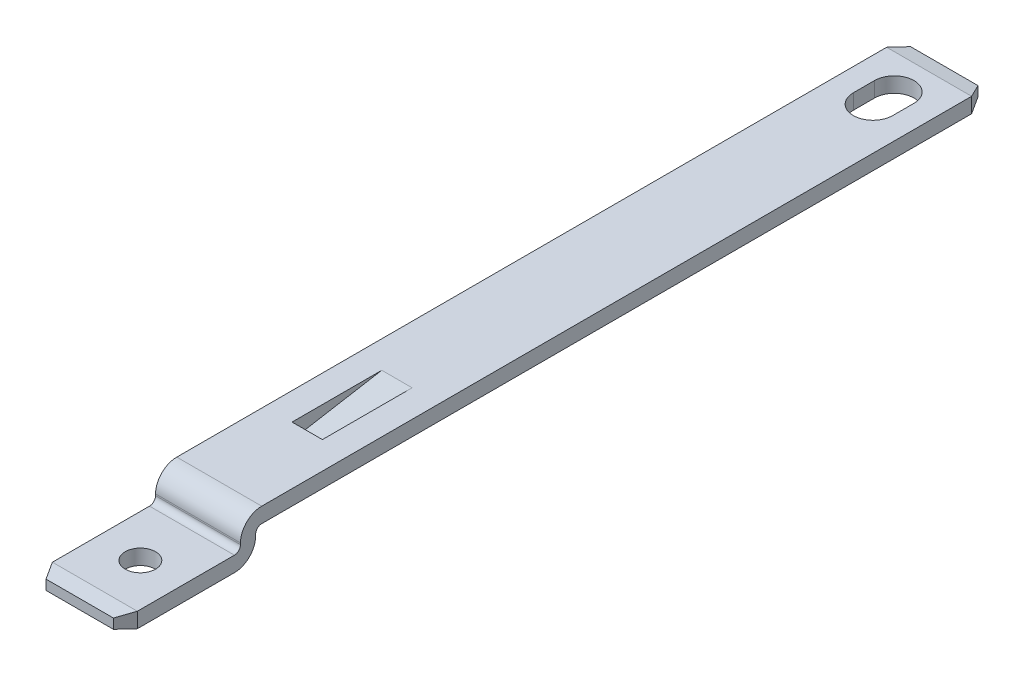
ISO-10303-21;
HEADER;
FILE_DESCRIPTION(('STEP AP214'),'2;1');
FILE_NAME('part.step','',(''),(''),'','','');
FILE_SCHEMA(('AUTOMOTIVE_DESIGN { 1 0 10303 214 1 1 1 1 }'));
ENDSEC;
DATA;
#1=APPLICATION_CONTEXT('core data for automotive mechanical design processes');
#2=APPLICATION_PROTOCOL_DEFINITION('international standard','automotive_design',2000,#1);
#3=PRODUCT_CONTEXT('',#1,'mechanical');
#4=PRODUCT('Part','Part','',(#3));
#5=PRODUCT_RELATED_PRODUCT_CATEGORY('part','',(#4));
#6=PRODUCT_DEFINITION_FORMATION('','',#4);
#7=PRODUCT_DEFINITION_CONTEXT('part definition',#1,'design');
#8=PRODUCT_DEFINITION('design','',#6,#7);
#9=PRODUCT_DEFINITION_SHAPE('','',#8);
#10=(LENGTH_UNIT() NAMED_UNIT(*) SI_UNIT(.MILLI.,.METRE.));
#11=(NAMED_UNIT(*) PLANE_ANGLE_UNIT() SI_UNIT($,.RADIAN.));
#12=(NAMED_UNIT(*) SI_UNIT($,.STERADIAN.) SOLID_ANGLE_UNIT());
#13=UNCERTAINTY_MEASURE_WITH_UNIT(LENGTH_MEASURE(1.E-05),#10,'distance_accuracy_value','');
#14=(GEOMETRIC_REPRESENTATION_CONTEXT(3) GLOBAL_UNCERTAINTY_ASSIGNED_CONTEXT((#13)) GLOBAL_UNIT_ASSIGNED_CONTEXT((#10,
#11,#12)) REPRESENTATION_CONTEXT('',''));
#15=CARTESIAN_POINT('',(0.,0.,0.));
#16=DIRECTION('',(0.,0.,1.));
#17=DIRECTION('',(1.,0.,0.));
#18=AXIS2_PLACEMENT_3D('',#15,#16,#17);
#19=CARTESIAN_POINT('',(1.45,3.10000000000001,4.5436678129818));
#20=DIRECTION('',(0.,0.,-1.));
#21=DIRECTION('',(0.,1.,0.));
#22=AXIS2_PLACEMENT_3D('',#19,#20,#21);
#23=PLANE('',#22);
#24=DIRECTION('',(0.,1.,0.));
#25=VECTOR('',#24,1.);
#26=CARTESIAN_POINT('',(1.16132486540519,3.10000000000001,4.5436678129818));
#27=LINE('',#26,#25);
#28=CARTESIAN_POINT('',(1.16132486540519,3.51183650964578,4.5436678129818));
#29=VERTEX_POINT('',#28);
#30=CARTESIAN_POINT('',(1.16132486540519,3.18816349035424,4.5436678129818));
#31=VERTEX_POINT('',#30);
#32=EDGE_CURVE('E344',#29,#31,#27,.F.);
#33=ORIENTED_EDGE('',*,*,#32,.F.);
#34=DIRECTION('',(1.,0.,0.));
#35=VECTOR('',#34,1.);
#36=CARTESIAN_POINT('',(1.45,3.51183650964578,4.5436678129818));
#37=LINE('',#36,#35);
#38=CARTESIAN_POINT('',(-1.06132486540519,3.51183650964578,4.5436678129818));
#39=VERTEX_POINT('',#38);
#40=EDGE_CURVE('E325',#29,#39,#37,.F.);
#41=ORIENTED_EDGE('',*,*,#40,.T.);
#42=DIRECTION('',(0.,1.,0.));
#43=VECTOR('',#42,1.);
#44=CARTESIAN_POINT('',(-1.06132486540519,3.10000000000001,4.5436678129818));
#45=LINE('',#44,#43);
#46=CARTESIAN_POINT('',(-1.06132486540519,3.18816349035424,4.5436678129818));
#47=VERTEX_POINT('',#46);
#48=EDGE_CURVE('E350',#47,#39,#45,.T.);
#49=ORIENTED_EDGE('',*,*,#48,.F.);
#50=DIRECTION('',(1.,0.,0.));
#51=VECTOR('',#50,1.);
#52=CARTESIAN_POINT('',(1.45,3.18816349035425,4.5436678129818));
#53=LINE('',#52,#51);
#54=EDGE_CURVE('E321',#31,#47,#53,.F.);
#55=ORIENTED_EDGE('',*,*,#54,.F.);
#56=EDGE_LOOP('',(#33,#41,#49,#55));
#57=FACE_BOUND('',#56,.T.);
#58=ADVANCED_FACE('F14',(#57),#23,.F.);
#59=CARTESIAN_POINT('',(1.45,3.85000000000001,0.1436678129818));
#60=DIRECTION('',(0.,0.,1.));
#61=DIRECTION('',(0.,-1.,0.));
#62=AXIS2_PLACEMENT_3D('',#59,#60,#61);
#63=PLANE('',#62);
#64=DIRECTION('',(-1.,0.,0.));
#65=VECTOR('',#64,1.);
#66=CARTESIAN_POINT('',(1.45,3.80000000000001,0.143667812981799));
#67=LINE('',#66,#65);
#68=CARTESIAN_POINT('',(-1.35,3.80000000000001,0.143667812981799));
#69=VERTEX_POINT('',#68);
#70=CARTESIAN_POINT('',(1.45,3.80000000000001,0.1436678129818));
#71=VERTEX_POINT('',#70);
#72=EDGE_CURVE('E345',#69,#71,#67,.F.);
#73=ORIENTED_EDGE('',*,*,#72,.F.);
#74=DIRECTION('',(0.,-1.,0.));
#75=VECTOR('',#74,1.);
#76=CARTESIAN_POINT('',(-1.35,3.85000000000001,0.1436678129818));
#77=LINE('',#76,#75);
#78=CARTESIAN_POINT('',(-1.35,3.85000000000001,0.143667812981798));
#79=VERTEX_POINT('',#78);
#80=EDGE_CURVE('E341',#79,#69,#77,.T.);
#81=ORIENTED_EDGE('',*,*,#80,.F.);
#82=DIRECTION('',(1.,0.,0.));
#83=VECTOR('',#82,1.);
#84=CARTESIAN_POINT('',(-1.35,3.85000000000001,0.143667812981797));
#85=LINE('',#84,#83);
#86=CARTESIAN_POINT('',(1.45,3.85000000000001,0.143667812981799));
#87=VERTEX_POINT('',#86);
#88=EDGE_CURVE('E336',#79,#87,#85,.T.);
#89=ORIENTED_EDGE('',*,*,#88,.T.);
#90=DIRECTION('',(0.,-1.,0.));
#91=VECTOR('',#90,1.);
#92=CARTESIAN_POINT('',(1.45,3.85000000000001,0.1436678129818));
#93=LINE('',#92,#91);
#94=EDGE_CURVE('E335',#71,#87,#93,.F.);
#95=ORIENTED_EDGE('',*,*,#94,.F.);
#96=EDGE_LOOP('',(#73,#81,#89,#95));
#97=FACE_BOUND('',#96,.T.);
#98=ADVANCED_FACE('F441',(#97),#63,.F.);
#99=CARTESIAN_POINT('',(-0.449999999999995,3.54000000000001,-3.));
#100=DIRECTION('',(0.,-0.985444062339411,-0.169999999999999));
#101=DIRECTION('',(0.,0.169999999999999,-0.985444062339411));
#102=AXIS2_PLACEMENT_3D('',#99,#100,#101);
#103=PLANE('',#102);
#104=DIRECTION('',(0.,0.170000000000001,-0.98544406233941));
#105=VECTOR('',#104,1.);
#106=CARTESIAN_POINT('',(-0.449999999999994,3.54000000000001,-3.));
#107=LINE('',#106,#105);
#108=CARTESIAN_POINT('',(-0.449999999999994,3.54000000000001,-3.));
#109=VERTEX_POINT('',#108);
#110=CARTESIAN_POINT('',(-0.449999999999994,4.05000000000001,-5.9563321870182));
#111=VERTEX_POINT('',#110);
#112=EDGE_CURVE('E317',#109,#111,#107,.T.);
#113=ORIENTED_EDGE('',*,*,#112,.T.);
#114=DIRECTION('',(1.,0.,0.));
#115=VECTOR('',#114,1.);
#116=CARTESIAN_POINT('',(-0.449999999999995,4.05,-5.9563321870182));
#117=LINE('',#116,#115);
#118=CARTESIAN_POINT('',(0.550000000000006,4.05000000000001,-5.9563321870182));
#119=VERTEX_POINT('',#118);
#120=EDGE_CURVE('E200',#111,#119,#117,.T.);
#121=ORIENTED_EDGE('',*,*,#120,.T.);
#122=DIRECTION('',(0.,0.170000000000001,-0.98544406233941));
#123=VECTOR('',#122,1.);
#124=CARTESIAN_POINT('',(0.550000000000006,3.54000000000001,-3.));
#125=LINE('',#124,#123);
#126=CARTESIAN_POINT('',(0.550000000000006,3.54000000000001,-3.));
#127=VERTEX_POINT('',#126);
#128=EDGE_CURVE('E307',#127,#119,#125,.T.);
#129=ORIENTED_EDGE('',*,*,#128,.F.);
#130=DIRECTION('',(1.,0.,0.));
#131=VECTOR('',#130,1.);
#132=CARTESIAN_POINT('',(-0.449999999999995,3.54000000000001,-3.));
#133=LINE('',#132,#131);
#134=EDGE_CURVE('E310',#109,#127,#133,.T.);
#135=ORIENTED_EDGE('',*,*,#134,.F.);
#136=EDGE_LOOP('',(#113,#121,#129,#135));
#137=FACE_BOUND('',#136,.T.);
#138=ADVANCED_FACE('F524',(#137),#103,.T.);
#139=CARTESIAN_POINT('',(1.45,3.80000000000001,0.843667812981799));
#140=DIRECTION('',(-1.,0.,0.));
#141=DIRECTION('',(0.,0.,1.));
#142=AXIS2_PLACEMENT_3D('',#139,#140,#141);
#143=CYLINDRICAL_SURFACE('',#142,0.2);
#144=CARTESIAN_POINT('',(1.45,3.80000000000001,0.843667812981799));
#145=DIRECTION('',(-1.,0.,0.));
#146=DIRECTION('',(0.,0.,1.));
#147=AXIS2_PLACEMENT_3D('',#144,#145,#146);
#148=CIRCLE('',#147,0.2);
#149=CARTESIAN_POINT('',(1.45,3.80000000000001,0.6436678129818));
#150=VERTEX_POINT('',#149);
#151=CARTESIAN_POINT('',(1.45,3.60000000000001,0.843667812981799));
#152=VERTEX_POINT('',#151);
#153=EDGE_CURVE('E199',#150,#152,#148,.T.);
#154=ORIENTED_EDGE('',*,*,#153,.F.);
#155=DIRECTION('',(1.,0.,0.));
#156=VECTOR('',#155,1.);
#157=CARTESIAN_POINT('',(1.45,3.80000000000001,0.6436678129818));
#158=LINE('',#157,#156);
#159=CARTESIAN_POINT('',(-1.35,3.80000000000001,0.6436678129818));
#160=VERTEX_POINT('',#159);
#161=EDGE_CURVE('E196',#160,#150,#158,.T.);
#162=ORIENTED_EDGE('',*,*,#161,.F.);
#163=CARTESIAN_POINT('',(-1.35,3.80000000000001,0.843667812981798));
#164=DIRECTION('',(-1.,0.,0.));
#165=DIRECTION('',(0.,0.,1.));
#166=AXIS2_PLACEMENT_3D('',#163,#164,#165);
#167=CIRCLE('',#166,0.2);
#168=CARTESIAN_POINT('',(-1.35,3.60000000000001,0.843667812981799));
#169=VERTEX_POINT('',#168);
#170=EDGE_CURVE('E17',#169,#160,#167,.F.);
#171=ORIENTED_EDGE('',*,*,#170,.F.);
#172=DIRECTION('',(1.,0.,0.));
#173=VECTOR('',#172,1.);
#174=CARTESIAN_POINT('',(1.45,3.60000000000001,0.843667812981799));
#175=LINE('',#174,#173);
#176=EDGE_CURVE('E193',#169,#152,#175,.T.);
#177=ORIENTED_EDGE('',*,*,#176,.T.);
#178=EDGE_LOOP('',(#154,#162,#171,#177));
#179=FACE_BOUND('',#178,.T.);
#180=ADVANCED_FACE('F192',(#179),#143,.F.);
#181=CARTESIAN_POINT('',(1.45,3.51183650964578,4.5436678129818));
#182=DIRECTION('',(0.,-0.984807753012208,-0.17364817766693));
#183=DIRECTION('',(0.,0.17364817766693,-0.984807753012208));
#184=AXIS2_PLACEMENT_3D('',#181,#182,#183);
#185=PLANE('',#184);
#186=DIRECTION('',(-0.494270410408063,-0.150953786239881,0.8561014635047));
#187=VECTOR('',#186,1.);
#188=CARTESIAN_POINT('',(1.45,3.60000000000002,4.0436678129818));
#189=LINE('',#188,#187);
#190=CARTESIAN_POINT('',(1.45,3.60000000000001,4.0436678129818));
#191=VERTEX_POINT('',#190);
#192=EDGE_CURVE('E326',#191,#29,#189,.T.);
#193=ORIENTED_EDGE('',*,*,#192,.F.);
#194=DIRECTION('',(1.,0.,0.));
#195=VECTOR('',#194,1.);
#196=CARTESIAN_POINT('',(1.45,3.60000000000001,4.0436678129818));
#197=LINE('',#196,#195);
#198=CARTESIAN_POINT('',(-1.35,3.60000000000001,4.0436678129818));
#199=VERTEX_POINT('',#198);
#200=EDGE_CURVE('E208',#191,#199,#197,.F.);
#201=ORIENTED_EDGE('',*,*,#200,.T.);
#202=DIRECTION('',(-0.494270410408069,0.150953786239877,-0.856101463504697));
#203=VECTOR('',#202,1.);
#204=CARTESIAN_POINT('',(-1.06132486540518,3.51183650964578,4.5436678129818));
#205=LINE('',#204,#203);
#206=EDGE_CURVE('E293',#39,#199,#205,.T.);
#207=ORIENTED_EDGE('',*,*,#206,.F.);
#208=ORIENTED_EDGE('',*,*,#40,.F.);
#209=EDGE_LOOP('',(#193,#201,#207,#208));
#210=FACE_BOUND('',#209,.T.);
#211=ADVANCED_FACE('F462',(#210),#185,.F.);
#212=CARTESIAN_POINT('',(1.45,3.10000000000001,4.0436678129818));
#213=DIRECTION('',(0.,-0.984807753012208,0.173648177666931));
#214=DIRECTION('',(0.,-0.173648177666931,-0.984807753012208));
#215=AXIS2_PLACEMENT_3D('',#212,#213,#214);
#216=PLANE('',#215);
#217=ORIENTED_EDGE('',*,*,#54,.T.);
#218=DIRECTION('',(0.494270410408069,0.150953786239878,0.856101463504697));
#219=VECTOR('',#218,1.);
#220=CARTESIAN_POINT('',(-1.35,3.10000000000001,4.0436678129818));
#221=LINE('',#220,#219);
#222=CARTESIAN_POINT('',(-1.35,3.10000000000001,4.0436678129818));
#223=VERTEX_POINT('',#222);
#224=EDGE_CURVE('E295',#223,#47,#221,.T.);
#225=ORIENTED_EDGE('',*,*,#224,.F.);
#226=DIRECTION('',(1.,0.,0.));
#227=VECTOR('',#226,1.);
#228=CARTESIAN_POINT('',(1.45,3.10000000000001,4.0436678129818));
#229=LINE('',#228,#227);
#230=CARTESIAN_POINT('',(1.45,3.1,4.0436678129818));
#231=VERTEX_POINT('',#230);
#232=EDGE_CURVE('E264',#231,#223,#229,.F.);
#233=ORIENTED_EDGE('',*,*,#232,.F.);
#234=DIRECTION('',(0.494270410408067,-0.15095378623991,-0.856101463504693));
#235=VECTOR('',#234,1.);
#236=CARTESIAN_POINT('',(1.16132486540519,3.18816349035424,4.5436678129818));
#237=LINE('',#236,#235);
#238=EDGE_CURVE('E266',#31,#231,#237,.T.);
#239=ORIENTED_EDGE('',*,*,#238,.F.);
#240=EDGE_LOOP('',(#217,#225,#233,#239));
#241=FACE_BOUND('',#240,.T.);
#242=ADVANCED_FACE('F455',(#241),#216,.T.);
#243=CARTESIAN_POINT('',(1.45,3.80000000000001,0.843667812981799));
#244=DIRECTION('',(-1.,0.,0.));
#245=DIRECTION('',(0.,0.,1.));
#246=AXIS2_PLACEMENT_3D('',#243,#244,#245);
#247=CYLINDRICAL_SURFACE('',#246,0.7);
#248=ORIENTED_EDGE('',*,*,#72,.T.);
#249=CARTESIAN_POINT('',(1.45,3.80000000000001,0.843667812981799));
#250=DIRECTION('',(-1.,0.,0.));
#251=DIRECTION('',(0.,0.,1.));
#252=AXIS2_PLACEMENT_3D('',#249,#250,#251);
#253=CIRCLE('',#252,0.7);
#254=CARTESIAN_POINT('',(1.45,3.1,0.843667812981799));
#255=VERTEX_POINT('',#254);
#256=EDGE_CURVE('E348',#71,#255,#253,.T.);
#257=ORIENTED_EDGE('',*,*,#256,.T.);
#258=DIRECTION('',(1.,0.,0.));
#259=VECTOR('',#258,1.);
#260=CARTESIAN_POINT('',(1.45,3.10000000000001,0.843667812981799));
#261=LINE('',#260,#259);
#262=CARTESIAN_POINT('',(-1.35,3.10000000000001,0.843667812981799));
#263=VERTEX_POINT('',#262);
#264=EDGE_CURVE('E260',#263,#255,#261,.T.);
#265=ORIENTED_EDGE('',*,*,#264,.F.);
#266=CARTESIAN_POINT('',(-1.35,3.80000000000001,0.843667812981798));
#267=DIRECTION('',(-1.,0.,0.));
#268=DIRECTION('',(0.,0.,1.));
#269=AXIS2_PLACEMENT_3D('',#266,#267,#268);
#270=CIRCLE('',#269,0.7);
#271=EDGE_CURVE('E324',#263,#69,#270,.F.);
#272=ORIENTED_EDGE('',*,*,#271,.T.);
#273=EDGE_LOOP('',(#248,#257,#265,#272));
#274=FACE_BOUND('',#273,.T.);
#275=ADVANCED_FACE('F446',(#274),#247,.T.);
#276=CARTESIAN_POINT('',(0.0499999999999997,-25.0738992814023,2.54366781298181));
#277=DIRECTION('',(0.,1.,0.));
#278=DIRECTION('',(0.,0.,1.));
#279=AXIS2_PLACEMENT_3D('',#276,#277,#278);
#280=CYLINDRICAL_SURFACE('',#279,0.5);
#281=CARTESIAN_POINT('',(0.0499999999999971,3.60000000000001,2.5436678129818));
#282=DIRECTION('',(0.,1.,0.));
#283=DIRECTION('',(0.,0.,1.));
#284=AXIS2_PLACEMENT_3D('',#281,#282,#283);
#285=CIRCLE('',#284,0.5);
#286=CARTESIAN_POINT('',(0.0499999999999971,3.60000000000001,3.0436678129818));
#287=VERTEX_POINT('',#286);
#288=EDGE_CURVE('E271',#287,#287,#285,.T.);
#289=ORIENTED_EDGE('',*,*,#288,.T.);
#290=EDGE_LOOP('',(#289));
#291=FACE_BOUND('',#290,.T.);
#292=CARTESIAN_POINT('',(0.0499999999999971,3.10000000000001,2.5436678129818));
#293=DIRECTION('',(0.,1.,0.));
#294=DIRECTION('',(0.,0.,1.));
#295=AXIS2_PLACEMENT_3D('',#292,#293,#294);
#296=CIRCLE('',#295,0.5);
#297=CARTESIAN_POINT('',(0.0499999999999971,3.10000000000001,3.0436678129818));
#298=VERTEX_POINT('',#297);
#299=EDGE_CURVE('E263',#298,#298,#296,.T.);
#300=ORIENTED_EDGE('',*,*,#299,.F.);
#301=EDGE_LOOP('',(#300));
#302=FACE_BOUND('',#301,.T.);
#303=ADVANCED_FACE('F602',(#291,#302),#280,.F.);
#304=CARTESIAN_POINT('',(1.45000000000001,4.05,-23.4563321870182));
#305=DIRECTION('',(0.,-0.984807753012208,-0.173648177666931));
#306=DIRECTION('',(0.,0.173648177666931,-0.984807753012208));
#307=AXIS2_PLACEMENT_3D('',#304,#305,#306);
#308=PLANE('',#307);
#309=DIRECTION('',(1.,0.,0.));
#310=VECTOR('',#309,1.);
#311=CARTESIAN_POINT('',(-1.34999999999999,4.13816349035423,-23.9563321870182));
#312=LINE('',#311,#310);
#313=CARTESIAN_POINT('',(-1.06132486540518,4.13816349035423,-23.9563321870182));
#314=VERTEX_POINT('',#313);
#315=CARTESIAN_POINT('',(1.1613248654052,4.13816349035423,-23.9563321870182));
#316=VERTEX_POINT('',#315);
#317=EDGE_CURVE('E278',#314,#316,#312,.T.);
#318=ORIENTED_EDGE('',*,*,#317,.T.);
#319=DIRECTION('',(-0.494270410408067,0.150953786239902,-0.856101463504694));
#320=VECTOR('',#319,1.);
#321=CARTESIAN_POINT('',(1.44999999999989,4.05000000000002,-23.4563321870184));
#322=LINE('',#321,#320);
#323=CARTESIAN_POINT('',(1.44999999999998,4.05000000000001,-23.4563321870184));
#324=VERTEX_POINT('',#323);
#325=EDGE_CURVE('E276',#324,#316,#322,.T.);
#326=ORIENTED_EDGE('',*,*,#325,.F.);
#327=DIRECTION('',(1.,0.,0.));
#328=VECTOR('',#327,1.);
#329=CARTESIAN_POINT('',(1.45,4.05,-23.4563321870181));
#330=LINE('',#329,#328);
#331=CARTESIAN_POINT('',(-1.35,4.05,-23.4563321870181));
#332=VERTEX_POINT('',#331);
#333=EDGE_CURVE('E281',#332,#324,#330,.T.);
#334=ORIENTED_EDGE('',*,*,#333,.F.);
#335=DIRECTION('',(-0.49427041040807,-0.150953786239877,0.856101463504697));
#336=VECTOR('',#335,1.);
#337=CARTESIAN_POINT('',(-1.06132486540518,4.13816349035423,-23.9563321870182));
#338=LINE('',#337,#336);
#339=EDGE_CURVE('E291',#314,#332,#338,.T.);
#340=ORIENTED_EDGE('',*,*,#339,.F.);
#341=EDGE_LOOP('',(#318,#326,#334,#340));
#342=FACE_BOUND('',#341,.T.);
#343=ADVANCED_FACE('F426',(#342),#308,.T.);
#344=CARTESIAN_POINT('',(-1.35,3.85000000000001,-0.056332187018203));
#345=DIRECTION('',(1.,0.,0.));
#346=DIRECTION('',(0.,0.,-1.));
#347=AXIS2_PLACEMENT_3D('',#344,#345,#346);
#348=CYLINDRICAL_SURFACE('',#347,0.2);
#349=CARTESIAN_POINT('',(1.45,3.85000000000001,-0.056332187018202));
#350=DIRECTION('',(1.,0.,0.));
#351=DIRECTION('',(0.,0.,-1.));
#352=AXIS2_PLACEMENT_3D('',#349,#350,#351);
#353=CIRCLE('',#352,0.2);
#354=CARTESIAN_POINT('',(1.45,4.05000000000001,-0.0563321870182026));
#355=VERTEX_POINT('',#354);
#356=EDGE_CURVE('E320',#87,#355,#353,.F.);
#357=ORIENTED_EDGE('',*,*,#356,.F.);
#358=ORIENTED_EDGE('',*,*,#88,.F.);
#359=CARTESIAN_POINT('',(-1.35,3.85000000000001,-0.056332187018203));
#360=DIRECTION('',(1.,0.,0.));
#361=DIRECTION('',(0.,0.,-1.));
#362=AXIS2_PLACEMENT_3D('',#359,#360,#361);
#363=CIRCLE('',#362,0.2);
#364=CARTESIAN_POINT('',(-1.35,4.05,-0.056332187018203));
#365=VERTEX_POINT('',#364);
#366=EDGE_CURVE('E339',#365,#79,#363,.T.);
#367=ORIENTED_EDGE('',*,*,#366,.F.);
#368=DIRECTION('',(1.,0.,0.));
#369=VECTOR('',#368,1.);
#370=CARTESIAN_POINT('',(1.45,4.05000000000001,-0.0563321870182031));
#371=LINE('',#370,#369);
#372=EDGE_CURVE('E255',#355,#365,#371,.F.);
#373=ORIENTED_EDGE('',*,*,#372,.F.);
#374=EDGE_LOOP('',(#357,#358,#367,#373));
#375=FACE_BOUND('',#374,.T.);
#376=ADVANCED_FACE('F437',(#375),#348,.F.);
#377=CARTESIAN_POINT('',(-0.449999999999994,4.05000000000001,-5.9563321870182));
#378=DIRECTION('',(1.,0.,0.));
#379=DIRECTION('',(0.,1.,0.));
#380=AXIS2_PLACEMENT_3D('',#377,#378,#379);
#381=PLANE('',#380);
#382=DIRECTION('',(0.,0.,-1.));
#383=VECTOR('',#382,1.);
#384=CARTESIAN_POINT('',(-0.449999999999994,4.05000000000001,4.5436678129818));
#385=LINE('',#384,#383);
#386=CARTESIAN_POINT('',(-0.449999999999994,4.05000000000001,-3.01515571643));
#387=VERTEX_POINT('',#386);
#388=EDGE_CURVE('E247',#111,#387,#385,.F.);
#389=ORIENTED_EDGE('',*,*,#388,.F.);
#390=ORIENTED_EDGE('',*,*,#112,.F.);
#391=DIRECTION('',(0.,-1.,0.));
#392=VECTOR('',#391,1.);
#393=CARTESIAN_POINT('',(-0.449999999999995,4.04738547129,-3.));
#394=LINE('',#393,#392);
#395=CARTESIAN_POINT('',(-0.449999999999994,4.04738547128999,-3.));
#396=VERTEX_POINT('',#395);
#397=EDGE_CURVE('E312',#396,#109,#394,.T.);
#398=ORIENTED_EDGE('',*,*,#397,.F.);
#399=DIRECTION('',(0.,-0.169999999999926,0.985444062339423));
#400=VECTOR('',#399,1.);
#401=CARTESIAN_POINT('',(-0.449999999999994,4.05000000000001,-3.01515571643));
#402=LINE('',#401,#400);
#403=EDGE_CURVE('E315',#387,#396,#402,.T.);
#404=ORIENTED_EDGE('',*,*,#403,.F.);
#405=EDGE_LOOP('',(#389,#390,#398,#404));
#406=FACE_BOUND('',#405,.T.);
#407=ADVANCED_FACE('F514',(#406),#381,.F.);
#408=CARTESIAN_POINT('',(-0.449999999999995,4.04738547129,-3.));
#409=DIRECTION('',(0.,0.,1.));
#410=DIRECTION('',(0.,-1.,0.));
#411=AXIS2_PLACEMENT_3D('',#408,#409,#410);
#412=PLANE('',#411);
#413=ORIENTED_EDGE('',*,*,#397,.T.);
#414=ORIENTED_EDGE('',*,*,#134,.T.);
#415=DIRECTION('',(0.,1.,0.));
#416=VECTOR('',#415,1.);
#417=CARTESIAN_POINT('',(0.550000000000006,4.05000000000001,-3.));
#418=LINE('',#417,#416);
#419=CARTESIAN_POINT('',(0.550000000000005,4.04738547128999,-3.));
#420=VERTEX_POINT('',#419);
#421=EDGE_CURVE('E304',#420,#127,#418,.F.);
#422=ORIENTED_EDGE('',*,*,#421,.F.);
#423=DIRECTION('',(1.,0.,0.));
#424=VECTOR('',#423,1.);
#425=CARTESIAN_POINT('',(-0.449999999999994,4.04738547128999,-3.));
#426=LINE('',#425,#424);
#427=EDGE_CURVE('E238',#396,#420,#426,.T.);
#428=ORIENTED_EDGE('',*,*,#427,.F.);
#429=EDGE_LOOP('',(#413,#414,#422,#428));
#430=FACE_BOUND('',#429,.T.);
#431=ADVANCED_FACE('F519',(#430),#412,.T.);
#432=CARTESIAN_POINT('',(0.550000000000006,4.05000000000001,-5.9563321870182));
#433=DIRECTION('',(1.,0.,0.));
#434=DIRECTION('',(0.,1.,0.));
#435=AXIS2_PLACEMENT_3D('',#432,#433,#434);
#436=PLANE('',#435);
#437=DIRECTION('',(0.,-0.169999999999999,0.985444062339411));
#438=VECTOR('',#437,1.);
#439=CARTESIAN_POINT('',(0.550000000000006,4.55000000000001,-5.9135206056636));
#440=LINE('',#439,#438);
#441=CARTESIAN_POINT('',(0.550000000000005,4.05000000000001,-3.0151557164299));
#442=VERTEX_POINT('',#441);
#443=EDGE_CURVE('E235',#420,#442,#440,.F.);
#444=ORIENTED_EDGE('',*,*,#443,.F.);
#445=ORIENTED_EDGE('',*,*,#421,.T.);
#446=ORIENTED_EDGE('',*,*,#128,.T.);
#447=DIRECTION('',(0.,0.,-1.));
#448=VECTOR('',#447,1.);
#449=CARTESIAN_POINT('',(0.550000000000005,4.05000000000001,4.5436678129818));
#450=LINE('',#449,#448);
#451=EDGE_CURVE('E250',#442,#119,#450,.T.);
#452=ORIENTED_EDGE('',*,*,#451,.F.);
#453=EDGE_LOOP('',(#444,#445,#446,#452));
#454=FACE_BOUND('',#453,.T.);
#455=ADVANCED_FACE('F522',(#454),#436,.T.);
#456=CARTESIAN_POINT('',(1.45,3.85000000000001,0.6436678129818));
#457=DIRECTION('',(0.,0.,1.));
#458=DIRECTION('',(0.,-1.,0.));
#459=AXIS2_PLACEMENT_3D('',#456,#457,#458);
#460=PLANE('',#459);
#461=DIRECTION('',(0.,-1.,0.));
#462=VECTOR('',#461,1.);
#463=CARTESIAN_POINT('',(-1.35,3.85000000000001,0.6436678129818));
#464=LINE('',#463,#462);
#465=CARTESIAN_POINT('',(-1.35,3.85000000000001,0.643667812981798));
#466=VERTEX_POINT('',#465);
#467=EDGE_CURVE('E299',#466,#160,#464,.T.);
#468=ORIENTED_EDGE('',*,*,#467,.T.);
#469=ORIENTED_EDGE('',*,*,#161,.T.);
#470=DIRECTION('',(0.,-1.,0.));
#471=VECTOR('',#470,1.);
#472=CARTESIAN_POINT('',(1.45,3.85000000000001,0.6436678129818));
#473=LINE('',#472,#471);
#474=CARTESIAN_POINT('',(1.45,3.85000000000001,0.643667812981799));
#475=VERTEX_POINT('',#474);
#476=EDGE_CURVE('E302',#150,#475,#473,.F.);
#477=ORIENTED_EDGE('',*,*,#476,.T.);
#478=DIRECTION('',(1.,0.,0.));
#479=VECTOR('',#478,1.);
#480=CARTESIAN_POINT('',(-1.35,3.85000000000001,0.643667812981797));
#481=LINE('',#480,#479);
#482=EDGE_CURVE('E234',#466,#475,#481,.T.);
#483=ORIENTED_EDGE('',*,*,#482,.F.);
#484=EDGE_LOOP('',(#468,#469,#477,#483));
#485=FACE_BOUND('',#484,.T.);
#486=ADVANCED_FACE('F384',(#485),#460,.T.);
#487=CARTESIAN_POINT('',(-1.35,3.85000000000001,4.0436678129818));
#488=DIRECTION('',(-0.866025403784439,0.,0.5));
#489=DIRECTION('',(0.5,0.,0.866025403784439));
#490=AXIS2_PLACEMENT_3D('',#487,#488,#489);
#491=PLANE('',#490);
#492=ORIENTED_EDGE('',*,*,#206,.T.);
#493=DIRECTION('',(0.,1.,0.));
#494=VECTOR('',#493,1.);
#495=CARTESIAN_POINT('',(-1.35,3.85000000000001,4.0436678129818));
#496=LINE('',#495,#494);
#497=EDGE_CURVE('E215',#223,#199,#496,.T.);
#498=ORIENTED_EDGE('',*,*,#497,.F.);
#499=ORIENTED_EDGE('',*,*,#224,.T.);
#500=ORIENTED_EDGE('',*,*,#48,.T.);
#501=EDGE_LOOP('',(#492,#498,#499,#500));
#502=FACE_BOUND('',#501,.T.);
#503=ADVANCED_FACE('F458',(#502),#491,.T.);
#504=CARTESIAN_POINT('',(-1.06132486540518,4.05,-23.9563321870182));
#505=DIRECTION('',(-0.866025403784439,0.,-0.5));
#506=DIRECTION('',(-0.5,0.,0.866025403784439));
#507=AXIS2_PLACEMENT_3D('',#504,#505,#506);
#508=PLANE('',#507);
#509=DIRECTION('',(0.494270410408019,-0.150953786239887,-0.856101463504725));
#510=VECTOR('',#509,1.);
#511=CARTESIAN_POINT('',(-1.34999999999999,4.55000000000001,-23.4563321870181));
#512=LINE('',#511,#510);
#513=CARTESIAN_POINT('',(-1.34999999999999,4.55000000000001,-23.4563321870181));
#514=VERTEX_POINT('',#513);
#515=CARTESIAN_POINT('',(-1.06132486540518,4.46183650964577,-23.9563321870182));
#516=VERTEX_POINT('',#515);
#517=EDGE_CURVE('E287',#514,#516,#512,.T.);
#518=ORIENTED_EDGE('',*,*,#517,.T.);
#519=DIRECTION('',(0.,-1.,0.));
#520=VECTOR('',#519,1.);
#521=CARTESIAN_POINT('',(-1.06132486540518,4.05,-23.9563321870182));
#522=LINE('',#521,#520);
#523=EDGE_CURVE('E288',#516,#314,#522,.T.);
#524=ORIENTED_EDGE('',*,*,#523,.T.);
#525=ORIENTED_EDGE('',*,*,#339,.T.);
#526=DIRECTION('',(0.,1.,0.));
#527=VECTOR('',#526,1.);
#528=CARTESIAN_POINT('',(-1.34999999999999,3.85000000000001,-23.4563321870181));
#529=LINE('',#528,#527);
#530=EDGE_CURVE('E231',#514,#332,#529,.F.);
#531=ORIENTED_EDGE('',*,*,#530,.F.);
#532=EDGE_LOOP('',(#518,#524,#525,#531));
#533=FACE_BOUND('',#532,.T.);
#534=ADVANCED_FACE('F415',(#533),#508,.T.);
#535=CARTESIAN_POINT('',(-1.34999999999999,4.05,-23.9563321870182));
#536=DIRECTION('',(0.,0.,1.));
#537=DIRECTION('',(0.,-1.,0.));
#538=AXIS2_PLACEMENT_3D('',#535,#536,#537);
#539=PLANE('',#538);
#540=ORIENTED_EDGE('',*,*,#523,.F.);
#541=DIRECTION('',(1.,0.,0.));
#542=VECTOR('',#541,1.);
#543=CARTESIAN_POINT('',(-1.34999999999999,4.46183650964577,-23.9563321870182));
#544=LINE('',#543,#542);
#545=CARTESIAN_POINT('',(1.1613248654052,4.46183650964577,-23.9563321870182));
#546=VERTEX_POINT('',#545);
#547=EDGE_CURVE('E283',#516,#546,#544,.T.);
#548=ORIENTED_EDGE('',*,*,#547,.T.);
#549=DIRECTION('',(0.,1.,0.));
#550=VECTOR('',#549,1.);
#551=CARTESIAN_POINT('',(1.1613248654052,3.8,-23.9563321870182));
#552=LINE('',#551,#550);
#553=EDGE_CURVE('E209',#316,#546,#552,.T.);
#554=ORIENTED_EDGE('',*,*,#553,.F.);
#555=ORIENTED_EDGE('',*,*,#317,.F.);
#556=EDGE_LOOP('',(#540,#548,#554,#555));
#557=FACE_BOUND('',#556,.T.);
#558=ADVANCED_FACE('F422',(#557),#539,.F.);
#559=CARTESIAN_POINT('',(1.45000000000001,3.8,-23.4563321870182));
#560=DIRECTION('',(0.866025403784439,0.,-0.5));
#561=DIRECTION('',(-0.5,0.,-0.866025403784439));
#562=AXIS2_PLACEMENT_3D('',#559,#560,#561);
#563=PLANE('',#562);
#564=DIRECTION('',(0.494270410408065,0.150953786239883,0.856101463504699));
#565=VECTOR('',#564,1.);
#566=CARTESIAN_POINT('',(1.1613248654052,4.46183650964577,-23.9563321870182));
#567=LINE('',#566,#565);
#568=CARTESIAN_POINT('',(1.45000000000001,4.55,-23.4563321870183));
#569=VERTEX_POINT('',#568);
#570=EDGE_CURVE('E219',#546,#569,#567,.T.);
#571=ORIENTED_EDGE('',*,*,#570,.T.);
#572=DIRECTION('',(0.,1.,0.));
#573=VECTOR('',#572,1.);
#574=CARTESIAN_POINT('',(1.45,3.80000000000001,-23.4563321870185));
#575=LINE('',#574,#573);
#576=EDGE_CURVE('E369',#324,#569,#575,.T.);
#577=ORIENTED_EDGE('',*,*,#576,.F.);
#578=ORIENTED_EDGE('',*,*,#325,.T.);
#579=ORIENTED_EDGE('',*,*,#553,.T.);
#580=EDGE_LOOP('',(#571,#577,#578,#579));
#581=FACE_BOUND('',#580,.T.);
#582=ADVANCED_FACE('F579',(#581),#563,.T.);
#583=CARTESIAN_POINT('',(1.45,3.60000000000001,4.5436678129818));
#584=DIRECTION('',(0.,-1.,0.));
#585=DIRECTION('',(0.,0.,-1.));
#586=AXIS2_PLACEMENT_3D('',#583,#584,#585);
#587=PLANE('',#586);
#588=ORIENTED_EDGE('',*,*,#288,.F.);
#589=EDGE_LOOP('',(#588));
#590=FACE_BOUND('',#589,.T.);
#591=ORIENTED_EDGE('',*,*,#200,.F.);
#592=DIRECTION('',(0.,0.,1.));
#593=VECTOR('',#592,1.);
#594=CARTESIAN_POINT('',(1.45,3.60000000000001,0.1436678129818));
#595=LINE('',#594,#593);
#596=EDGE_CURVE('E207',#152,#191,#595,.T.);
#597=ORIENTED_EDGE('',*,*,#596,.F.);
#598=ORIENTED_EDGE('',*,*,#176,.F.);
#599=DIRECTION('',(0.,0.,1.));
#600=VECTOR('',#599,1.);
#601=CARTESIAN_POINT('',(-1.35,3.60000000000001,0.1436678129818));
#602=LINE('',#601,#600);
#603=EDGE_CURVE('E205',#199,#169,#602,.F.);
#604=ORIENTED_EDGE('',*,*,#603,.F.);
#605=EDGE_LOOP('',(#591,#597,#598,#604));
#606=FACE_BOUND('',#605,.T.);
#607=ADVANCED_FACE('F204',(#590,#606),#587,.F.);
#608=CARTESIAN_POINT('',(1.16132486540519,3.10000000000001,4.5436678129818));
#609=DIRECTION('',(0.866025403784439,0.,0.5));
#610=DIRECTION('',(0.5,0.,-0.866025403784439));
#611=AXIS2_PLACEMENT_3D('',#608,#609,#610);
#612=PLANE('',#611);
#613=ORIENTED_EDGE('',*,*,#192,.T.);
#614=ORIENTED_EDGE('',*,*,#32,.T.);
#615=ORIENTED_EDGE('',*,*,#238,.T.);
#616=DIRECTION('',(0.,1.,0.));
#617=VECTOR('',#616,1.);
#618=CARTESIAN_POINT('',(1.45,3.80000000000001,4.0436678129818));
#619=LINE('',#618,#617);
#620=EDGE_CURVE('E267',#191,#231,#619,.F.);
#621=ORIENTED_EDGE('',*,*,#620,.F.);
#622=EDGE_LOOP('',(#613,#614,#615,#621));
#623=FACE_BOUND('',#622,.T.);
#624=ADVANCED_FACE('F464',(#623),#612,.T.);
#625=CARTESIAN_POINT('',(1.45,3.10000000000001,4.5436678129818));
#626=DIRECTION('',(0.,-1.,0.));
#627=DIRECTION('',(0.,0.,-1.));
#628=AXIS2_PLACEMENT_3D('',#625,#626,#627);
#629=PLANE('',#628);
#630=ORIENTED_EDGE('',*,*,#299,.T.);
#631=EDGE_LOOP('',(#630));
#632=FACE_BOUND('',#631,.T.);
#633=DIRECTION('',(0.,0.,1.));
#634=VECTOR('',#633,1.);
#635=CARTESIAN_POINT('',(-1.35,3.10000000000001,0.1436678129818));
#636=LINE('',#635,#634);
#637=EDGE_CURVE('E221',#263,#223,#636,.T.);
#638=ORIENTED_EDGE('',*,*,#637,.F.);
#639=ORIENTED_EDGE('',*,*,#264,.T.);
#640=DIRECTION('',(0.,0.,1.));
#641=VECTOR('',#640,1.);
#642=CARTESIAN_POINT('',(1.45,3.09999999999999,0.1436678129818));
#643=LINE('',#642,#641);
#644=EDGE_CURVE('E270',#231,#255,#643,.F.);
#645=ORIENTED_EDGE('',*,*,#644,.F.);
#646=ORIENTED_EDGE('',*,*,#232,.T.);
#647=EDGE_LOOP('',(#638,#639,#645,#646));
#648=FACE_BOUND('',#647,.T.);
#649=ADVANCED_FACE('F451',(#632,#648),#629,.T.);
#650=CARTESIAN_POINT('',(1.45,4.05000000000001,4.5436678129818));
#651=DIRECTION('',(0.,-1.,0.));
#652=DIRECTION('',(0.,0.,-1.));
#653=AXIS2_PLACEMENT_3D('',#650,#651,#652);
#654=PLANE('',#653);
#655=DIRECTION('',(1.,0.,0.));
#656=VECTOR('',#655,1.);
#657=CARTESIAN_POINT('',(1.45,4.05000000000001,-2.9563321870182));
#658=LINE('',#657,#656);
#659=CARTESIAN_POINT('',(-0.449999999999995,4.05000000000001,-2.9563321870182));
#660=VERTEX_POINT('',#659);
#661=CARTESIAN_POINT('',(0.550000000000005,4.05000000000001,-2.9563321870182));
#662=VERTEX_POINT('',#661);
#663=EDGE_CURVE('E243',#660,#662,#658,.T.);
#664=ORIENTED_EDGE('',*,*,#663,.T.);
#665=DIRECTION('',(0.,0.,-1.));
#666=VECTOR('',#665,1.);
#667=CARTESIAN_POINT('',(0.550000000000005,4.05000000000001,4.5436678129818));
#668=LINE('',#667,#666);
#669=EDGE_CURVE('E241',#662,#442,#668,.T.);
#670=ORIENTED_EDGE('',*,*,#669,.T.);
#671=ORIENTED_EDGE('',*,*,#451,.T.);
#672=ORIENTED_EDGE('',*,*,#120,.F.);
#673=ORIENTED_EDGE('',*,*,#388,.T.);
#674=DIRECTION('',(0.,0.,-1.));
#675=VECTOR('',#674,1.);
#676=CARTESIAN_POINT('',(-0.449999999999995,4.05000000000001,4.5436678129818));
#677=LINE('',#676,#675);
#678=EDGE_CURVE('E245',#387,#660,#677,.F.);
#679=ORIENTED_EDGE('',*,*,#678,.T.);
#680=EDGE_LOOP('',(#664,#670,#671,#672,#673,#679));
#681=FACE_BOUND('',#680,.T.);
#682=CARTESIAN_POINT('',(0.0500000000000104,4.05,-22.3063321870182));
#683=DIRECTION('',(0.,1.,0.));
#684=DIRECTION('',(0.,0.,1.));
#685=AXIS2_PLACEMENT_3D('',#682,#683,#684);
#686=CIRCLE('',#685,0.65);
#687=CARTESIAN_POINT('',(0.70000000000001,4.05,-22.3063321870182));
#688=VERTEX_POINT('',#687);
#689=CARTESIAN_POINT('',(-0.59999999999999,4.05,-22.3063321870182));
#690=VERTEX_POINT('',#689);
#691=EDGE_CURVE('E365',#688,#690,#686,.T.);
#692=ORIENTED_EDGE('',*,*,#691,.T.);
#693=DIRECTION('',(0.,0.,1.));
#694=VECTOR('',#693,1.);
#695=CARTESIAN_POINT('',(-0.59999999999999,4.05,-21.6063321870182));
#696=LINE('',#695,#694);
#697=CARTESIAN_POINT('',(-0.59999999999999,4.05,-21.6063321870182));
#698=VERTEX_POINT('',#697);
#699=EDGE_CURVE('E256',#690,#698,#696,.T.);
#700=ORIENTED_EDGE('',*,*,#699,.T.);
#701=CARTESIAN_POINT('',(0.0500000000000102,4.05,-21.6063321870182));
#702=DIRECTION('',(0.,1.,0.));
#703=DIRECTION('',(0.,0.,1.));
#704=AXIS2_PLACEMENT_3D('',#701,#702,#703);
#705=CIRCLE('',#704,0.65);
#706=CARTESIAN_POINT('',(0.70000000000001,4.05,-21.6063321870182));
#707=VERTEX_POINT('',#706);
#708=EDGE_CURVE('E361',#698,#707,#705,.T.);
#709=ORIENTED_EDGE('',*,*,#708,.T.);
#710=DIRECTION('',(0.,0.,-1.));
#711=VECTOR('',#710,1.);
#712=CARTESIAN_POINT('',(0.70000000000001,4.05000000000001,4.5436678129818));
#713=LINE('',#712,#711);
#714=EDGE_CURVE('E253',#707,#688,#713,.T.);
#715=ORIENTED_EDGE('',*,*,#714,.T.);
#716=EDGE_LOOP('',(#692,#700,#709,#715));
#717=FACE_BOUND('',#716,.T.);
#718=DIRECTION('',(0.,0.,1.));
#719=VECTOR('',#718,1.);
#720=CARTESIAN_POINT('',(1.45,4.05000000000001,0.1436678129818));
#721=LINE('',#720,#719);
#722=EDGE_CURVE('E286',#355,#324,#721,.F.);
#723=ORIENTED_EDGE('',*,*,#722,.F.);
#724=ORIENTED_EDGE('',*,*,#372,.T.);
#725=DIRECTION('',(0.,0.,1.));
#726=VECTOR('',#725,1.);
#727=CARTESIAN_POINT('',(-1.35,4.04999999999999,0.1436678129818));
#728=LINE('',#727,#726);
#729=EDGE_CURVE('E228',#332,#365,#728,.T.);
#730=ORIENTED_EDGE('',*,*,#729,.F.);
#731=ORIENTED_EDGE('',*,*,#333,.T.);
#732=EDGE_LOOP('',(#723,#724,#730,#731));
#733=FACE_BOUND('',#732,.T.);
#734=ADVANCED_FACE('F432',(#681,#717,#733),#654,.T.);
#735=CARTESIAN_POINT('',(-0.449999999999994,4.55000000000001,-5.9135206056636));
#736=DIRECTION('',(0.,0.985444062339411,0.169999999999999));
#737=DIRECTION('',(0.,-0.169999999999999,0.985444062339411));
#738=AXIS2_PLACEMENT_3D('',#735,#736,#737);
#739=PLANE('',#738);
#740=ORIENTED_EDGE('',*,*,#427,.T.);
#741=ORIENTED_EDGE('',*,*,#443,.T.);
#742=DIRECTION('',(0.,-0.169999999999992,0.985444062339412));
#743=VECTOR('',#742,1.);
#744=CARTESIAN_POINT('',(0.550000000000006,4.55000000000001,-5.9135206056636));
#745=LINE('',#744,#743);
#746=CARTESIAN_POINT('',(0.550000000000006,4.55000000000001,-5.9135206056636));
#747=VERTEX_POINT('',#746);
#748=EDGE_CURVE('E403',#747,#442,#745,.T.);
#749=ORIENTED_EDGE('',*,*,#748,.F.);
#750=DIRECTION('',(1.,0.,0.));
#751=VECTOR('',#750,1.);
#752=CARTESIAN_POINT('',(-0.449999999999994,4.55000000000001,-5.9135206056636));
#753=LINE('',#752,#751);
#754=CARTESIAN_POINT('',(-0.449999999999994,4.55000000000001,-5.9135206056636));
#755=VERTEX_POINT('',#754);
#756=EDGE_CURVE('E32',#747,#755,#753,.F.);
#757=ORIENTED_EDGE('',*,*,#756,.T.);
#758=DIRECTION('',(0.,0.169999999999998,-0.985444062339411));
#759=VECTOR('',#758,1.);
#760=CARTESIAN_POINT('',(-0.449999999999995,4.05000000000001,-3.01515571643));
#761=LINE('',#760,#759);
#762=EDGE_CURVE('E476',#387,#755,#761,.T.);
#763=ORIENTED_EDGE('',*,*,#762,.F.);
#764=ORIENTED_EDGE('',*,*,#403,.T.);
#765=EDGE_LOOP('',(#740,#741,#749,#757,#763,#764));
#766=FACE_BOUND('',#765,.T.);
#767=ADVANCED_FACE('F504',(#766),#739,.T.);
#768=CARTESIAN_POINT('',(-1.35,3.85000000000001,-0.056332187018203));
#769=DIRECTION('',(1.,0.,0.));
#770=DIRECTION('',(0.,0.,-1.));
#771=AXIS2_PLACEMENT_3D('',#768,#769,#770);
#772=CYLINDRICAL_SURFACE('',#771,0.7);
#773=ORIENTED_EDGE('',*,*,#482,.T.);
#774=CARTESIAN_POINT('',(1.45,3.85000000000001,-0.056332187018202));
#775=DIRECTION('',(1.,0.,0.));
#776=DIRECTION('',(0.,0.,-1.));
#777=AXIS2_PLACEMENT_3D('',#774,#775,#776);
#778=CIRCLE('',#777,0.7);
#779=CARTESIAN_POINT('',(1.45000000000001,4.55000000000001,-0.0563321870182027));
#780=VERTEX_POINT('',#779);
#781=EDGE_CURVE('E367',#780,#475,#778,.T.);
#782=ORIENTED_EDGE('',*,*,#781,.F.);
#783=DIRECTION('',(1.,0.,0.));
#784=VECTOR('',#783,1.);
#785=CARTESIAN_POINT('',(1.45,4.55000000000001,-0.0563321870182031));
#786=LINE('',#785,#784);
#787=CARTESIAN_POINT('',(-1.35,4.55000000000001,-0.0563321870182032));
#788=VERTEX_POINT('',#787);
#789=EDGE_CURVE('E395',#780,#788,#786,.F.);
#790=ORIENTED_EDGE('',*,*,#789,.T.);
#791=CARTESIAN_POINT('',(-1.35,3.85000000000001,-0.056332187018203));
#792=DIRECTION('',(1.,0.,0.));
#793=DIRECTION('',(0.,0.,-1.));
#794=AXIS2_PLACEMENT_3D('',#791,#792,#793);
#795=CIRCLE('',#794,0.7);
#796=EDGE_CURVE('E217',#466,#788,#795,.F.);
#797=ORIENTED_EDGE('',*,*,#796,.F.);
#798=EDGE_LOOP('',(#773,#782,#790,#797));
#799=FACE_BOUND('',#798,.T.);
#800=ADVANCED_FACE('F399',(#799),#772,.T.);
#801=CARTESIAN_POINT('',(-1.35,3.85000000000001,0.1436678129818));
#802=DIRECTION('',(-1.,0.,0.));
#803=DIRECTION('',(0.,0.,1.));
#804=AXIS2_PLACEMENT_3D('',#801,#802,#803);
#805=PLANE('',#804);
#806=ORIENTED_EDGE('',*,*,#467,.F.);
#807=ORIENTED_EDGE('',*,*,#796,.T.);
#808=DIRECTION('',(0.,0.,-1.));
#809=VECTOR('',#808,1.);
#810=CARTESIAN_POINT('',(-1.35,4.55000000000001,4.5436678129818));
#811=LINE('',#810,#809);
#812=EDGE_CURVE('E225',#788,#514,#811,.T.);
#813=ORIENTED_EDGE('',*,*,#812,.T.);
#814=ORIENTED_EDGE('',*,*,#530,.T.);
#815=ORIENTED_EDGE('',*,*,#729,.T.);
#816=ORIENTED_EDGE('',*,*,#366,.T.);
#817=ORIENTED_EDGE('',*,*,#80,.T.);
#818=ORIENTED_EDGE('',*,*,#271,.F.);
#819=ORIENTED_EDGE('',*,*,#637,.T.);
#820=ORIENTED_EDGE('',*,*,#497,.T.);
#821=ORIENTED_EDGE('',*,*,#603,.T.);
#822=ORIENTED_EDGE('',*,*,#170,.T.);
#823=EDGE_LOOP('',(#806,#807,#813,#814,#815,#816,#817,#818,#819,#820,#821,#822));
#824=FACE_BOUND('',#823,.T.);
#825=ADVANCED_FACE('F212',(#824),#805,.T.);
#826=CARTESIAN_POINT('',(-1.34999999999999,4.46183650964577,-23.9563321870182));
#827=DIRECTION('',(0.,-0.984807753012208,0.173648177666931));
#828=DIRECTION('',(0.,-0.173648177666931,-0.984807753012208));
#829=AXIS2_PLACEMENT_3D('',#826,#827,#828);
#830=PLANE('',#829);
#831=ORIENTED_EDGE('',*,*,#517,.F.);
#832=DIRECTION('',(1.,0.,0.));
#833=VECTOR('',#832,1.);
#834=CARTESIAN_POINT('',(1.45,4.55,-23.4563321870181));
#835=LINE('',#834,#833);
#836=EDGE_CURVE('E398',#514,#569,#835,.T.);
#837=ORIENTED_EDGE('',*,*,#836,.T.);
#838=ORIENTED_EDGE('',*,*,#570,.F.);
#839=ORIENTED_EDGE('',*,*,#547,.F.);
#840=EDGE_LOOP('',(#831,#837,#838,#839));
#841=FACE_BOUND('',#840,.T.);
#842=ADVANCED_FACE('F418',(#841),#830,.F.);
#843=CARTESIAN_POINT('',(1.45,3.80000000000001,0.1436678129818));
#844=DIRECTION('',(1.,0.,0.));
#845=DIRECTION('',(0.,1.,0.));
#846=AXIS2_PLACEMENT_3D('',#843,#844,#845);
#847=PLANE('',#846);
#848=ORIENTED_EDGE('',*,*,#94,.T.);
#849=ORIENTED_EDGE('',*,*,#356,.T.);
#850=ORIENTED_EDGE('',*,*,#722,.T.);
#851=ORIENTED_EDGE('',*,*,#576,.T.);
#852=DIRECTION('',(0.,0.,-1.));
#853=VECTOR('',#852,1.);
#854=CARTESIAN_POINT('',(1.45000000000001,4.55000000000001,4.5436678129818));
#855=LINE('',#854,#853);
#856=EDGE_CURVE('E360',#569,#780,#855,.F.);
#857=ORIENTED_EDGE('',*,*,#856,.T.);
#858=ORIENTED_EDGE('',*,*,#781,.T.);
#859=ORIENTED_EDGE('',*,*,#476,.F.);
#860=ORIENTED_EDGE('',*,*,#153,.T.);
#861=ORIENTED_EDGE('',*,*,#596,.T.);
#862=ORIENTED_EDGE('',*,*,#620,.T.);
#863=ORIENTED_EDGE('',*,*,#644,.T.);
#864=ORIENTED_EDGE('',*,*,#256,.F.);
#865=EDGE_LOOP('',(#848,#849,#850,#851,#857,#858,#859,#860,#861,#862,#863,#864));
#866=FACE_BOUND('',#865,.T.);
#867=ADVANCED_FACE('F381',(#866),#847,.T.);
#868=CARTESIAN_POINT('',(0.050000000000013,-24.1238992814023,-22.3063321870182));
#869=DIRECTION('',(0.,1.,0.));
#870=DIRECTION('',(0.,0.,1.));
#871=AXIS2_PLACEMENT_3D('',#868,#869,#870);
#872=CYLINDRICAL_SURFACE('',#871,0.65);
#873=DIRECTION('',(0.,1.,0.));
#874=VECTOR('',#873,1.);
#875=CARTESIAN_POINT('',(0.700000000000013,-24.1238992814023,-22.3063321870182));
#876=LINE('',#875,#874);
#877=CARTESIAN_POINT('',(0.70000000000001,4.55,-22.3063321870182));
#878=VERTEX_POINT('',#877);
#879=EDGE_CURVE('E364',#688,#878,#876,.T.);
#880=ORIENTED_EDGE('',*,*,#879,.T.);
#881=CARTESIAN_POINT('',(0.0500000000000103,4.55,-22.3063321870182));
#882=DIRECTION('',(0.,1.,0.));
#883=DIRECTION('',(0.,0.,1.));
#884=AXIS2_PLACEMENT_3D('',#881,#882,#883);
#885=CIRCLE('',#884,0.65);
#886=CARTESIAN_POINT('',(-0.59999999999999,4.55,-22.3063321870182));
#887=VERTEX_POINT('',#886);
#888=EDGE_CURVE('E357',#878,#887,#885,.T.);
#889=ORIENTED_EDGE('',*,*,#888,.T.);
#890=DIRECTION('',(0.,1.,0.));
#891=VECTOR('',#890,1.);
#892=CARTESIAN_POINT('',(-0.599999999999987,-24.1238992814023,-22.3063321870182));
#893=LINE('',#892,#891);
#894=EDGE_CURVE('E259',#887,#690,#893,.F.);
#895=ORIENTED_EDGE('',*,*,#894,.T.);
#896=ORIENTED_EDGE('',*,*,#691,.F.);
#897=EDGE_LOOP('',(#880,#889,#895,#896));
#898=FACE_BOUND('',#897,.T.);
#899=ADVANCED_FACE('F555',(#898),#872,.F.);
#900=CARTESIAN_POINT('',(-0.599999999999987,-24.1238992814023,-21.6063321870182));
#901=DIRECTION('',(-1.,0.,0.));
#902=DIRECTION('',(0.,0.,1.));
#903=AXIS2_PLACEMENT_3D('',#900,#901,#902);
#904=PLANE('',#903);
#905=ORIENTED_EDGE('',*,*,#894,.F.);
#906=DIRECTION('',(0.,0.,-1.));
#907=VECTOR('',#906,1.);
#908=CARTESIAN_POINT('',(-0.59999999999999,4.55000000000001,4.5436678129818));
#909=LINE('',#908,#907);
#910=CARTESIAN_POINT('',(-0.59999999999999,4.55,-21.6063321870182));
#911=VERTEX_POINT('',#910);
#912=EDGE_CURVE('E356',#887,#911,#909,.F.);
#913=ORIENTED_EDGE('',*,*,#912,.T.);
#914=DIRECTION('',(0.,1.,0.));
#915=VECTOR('',#914,1.);
#916=CARTESIAN_POINT('',(-0.599999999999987,-24.1238992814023,-21.6063321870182));
#917=LINE('',#916,#915);
#918=EDGE_CURVE('E258',#911,#698,#917,.F.);
#919=ORIENTED_EDGE('',*,*,#918,.T.);
#920=ORIENTED_EDGE('',*,*,#699,.F.);
#921=EDGE_LOOP('',(#905,#913,#919,#920));
#922=FACE_BOUND('',#921,.T.);
#923=ADVANCED_FACE('F551',(#922),#904,.F.);
#924=CARTESIAN_POINT('',(0.0500000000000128,-24.1238992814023,-21.6063321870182));
#925=DIRECTION('',(0.,1.,0.));
#926=DIRECTION('',(0.,0.,1.));
#927=AXIS2_PLACEMENT_3D('',#924,#925,#926);
#928=CYLINDRICAL_SURFACE('',#927,0.65);
#929=ORIENTED_EDGE('',*,*,#918,.F.);
#930=CARTESIAN_POINT('',(0.0500000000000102,4.55,-21.6063321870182));
#931=DIRECTION('',(0.,1.,0.));
#932=DIRECTION('',(0.,0.,1.));
#933=AXIS2_PLACEMENT_3D('',#930,#931,#932);
#934=CIRCLE('',#933,0.65);
#935=CARTESIAN_POINT('',(0.70000000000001,4.55,-21.6063321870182));
#936=VERTEX_POINT('',#935);
#937=EDGE_CURVE('E352',#911,#936,#934,.T.);
#938=ORIENTED_EDGE('',*,*,#937,.T.);
#939=DIRECTION('',(0.,1.,0.));
#940=VECTOR('',#939,1.);
#941=CARTESIAN_POINT('',(0.700000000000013,-24.1238992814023,-21.6063321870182));
#942=LINE('',#941,#940);
#943=EDGE_CURVE('E473',#936,#707,#942,.F.);
#944=ORIENTED_EDGE('',*,*,#943,.T.);
#945=ORIENTED_EDGE('',*,*,#708,.F.);
#946=EDGE_LOOP('',(#929,#938,#944,#945));
#947=FACE_BOUND('',#946,.T.);
#948=ADVANCED_FACE('F547',(#947),#928,.F.);
#949=CARTESIAN_POINT('',(0.700000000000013,-24.1238992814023,-21.6063321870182));
#950=DIRECTION('',(1.,0.,0.));
#951=DIRECTION('',(0.,1.,0.));
#952=AXIS2_PLACEMENT_3D('',#949,#950,#951);
#953=PLANE('',#952);
#954=ORIENTED_EDGE('',*,*,#943,.F.);
#955=DIRECTION('',(0.,0.,-1.));
#956=VECTOR('',#955,1.);
#957=CARTESIAN_POINT('',(0.70000000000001,4.55000000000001,4.5436678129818));
#958=LINE('',#957,#956);
#959=EDGE_CURVE('E355',#936,#878,#958,.T.);
#960=ORIENTED_EDGE('',*,*,#959,.T.);
#961=ORIENTED_EDGE('',*,*,#879,.F.);
#962=ORIENTED_EDGE('',*,*,#714,.F.);
#963=EDGE_LOOP('',(#954,#960,#961,#962));
#964=FACE_BOUND('',#963,.T.);
#965=ADVANCED_FACE('F544',(#964),#953,.F.);
#966=CARTESIAN_POINT('',(-0.449999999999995,4.05000000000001,-2.9563321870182));
#967=DIRECTION('',(1.,0.,0.));
#968=DIRECTION('',(0.,1.,0.));
#969=AXIS2_PLACEMENT_3D('',#966,#967,#968);
#970=PLANE('',#969);
#971=DIRECTION('',(0.,1.,0.));
#972=VECTOR('',#971,1.);
#973=CARTESIAN_POINT('',(-0.449999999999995,4.05000000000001,-2.9563321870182));
#974=LINE('',#973,#972);
#975=CARTESIAN_POINT('',(-0.449999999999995,4.55000000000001,-2.9563321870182));
#976=VERTEX_POINT('',#975);
#977=EDGE_CURVE('E479',#660,#976,#974,.T.);
#978=ORIENTED_EDGE('',*,*,#977,.F.);
#979=ORIENTED_EDGE('',*,*,#678,.F.);
#980=ORIENTED_EDGE('',*,*,#762,.T.);
#981=DIRECTION('',(0.,0.,-1.));
#982=VECTOR('',#981,1.);
#983=CARTESIAN_POINT('',(-0.449999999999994,4.55000000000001,4.5436678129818));
#984=LINE('',#983,#982);
#985=EDGE_CURVE('E487',#755,#976,#984,.F.);
#986=ORIENTED_EDGE('',*,*,#985,.T.);
#987=EDGE_LOOP('',(#978,#979,#980,#986));
#988=FACE_BOUND('',#987,.T.);
#989=ADVANCED_FACE('F500',(#988),#970,.T.);
#990=CARTESIAN_POINT('',(0.550000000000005,4.05000000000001,-2.9563321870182));
#991=DIRECTION('',(0.,0.,-1.));
#992=DIRECTION('',(0.,1.,0.));
#993=AXIS2_PLACEMENT_3D('',#990,#991,#992);
#994=PLANE('',#993);
#995=ORIENTED_EDGE('',*,*,#663,.F.);
#996=ORIENTED_EDGE('',*,*,#977,.T.);
#997=DIRECTION('',(1.,0.,0.));
#998=VECTOR('',#997,1.);
#999=CARTESIAN_POINT('',(1.45,4.55000000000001,-2.9563321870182));
#1000=LINE('',#999,#998);
#1001=CARTESIAN_POINT('',(0.550000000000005,4.55000000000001,-2.9563321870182));
#1002=VERTEX_POINT('',#1001);
#1003=EDGE_CURVE('E23',#976,#1002,#1000,.T.);
#1004=ORIENTED_EDGE('',*,*,#1003,.T.);
#1005=DIRECTION('',(0.,1.,0.));
#1006=VECTOR('',#1005,1.);
#1007=CARTESIAN_POINT('',(0.550000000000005,4.05000000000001,-2.9563321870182));
#1008=LINE('',#1007,#1006);
#1009=EDGE_CURVE('E401',#662,#1002,#1008,.T.);
#1010=ORIENTED_EDGE('',*,*,#1009,.F.);
#1011=EDGE_LOOP('',(#995,#996,#1004,#1010));
#1012=FACE_BOUND('',#1011,.T.);
#1013=ADVANCED_FACE('F495',(#1012),#994,.T.);
#1014=CARTESIAN_POINT('',(0.550000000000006,4.05000000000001,-5.9563321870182));
#1015=DIRECTION('',(-1.,0.,0.));
#1016=DIRECTION('',(0.,0.,1.));
#1017=AXIS2_PLACEMENT_3D('',#1014,#1015,#1016);
#1018=PLANE('',#1017);
#1019=ORIENTED_EDGE('',*,*,#669,.F.);
#1020=ORIENTED_EDGE('',*,*,#1009,.T.);
#1021=DIRECTION('',(0.,0.,-1.));
#1022=VECTOR('',#1021,1.);
#1023=CARTESIAN_POINT('',(0.550000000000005,4.55000000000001,4.5436678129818));
#1024=LINE('',#1023,#1022);
#1025=EDGE_CURVE('E9',#1002,#747,#1024,.T.);
#1026=ORIENTED_EDGE('',*,*,#1025,.T.);
#1027=ORIENTED_EDGE('',*,*,#748,.T.);
#1028=EDGE_LOOP('',(#1019,#1020,#1026,#1027));
#1029=FACE_BOUND('',#1028,.T.);
#1030=ADVANCED_FACE('F509',(#1029),#1018,.T.);
#1031=CARTESIAN_POINT('',(1.45,4.55000000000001,4.5436678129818));
#1032=DIRECTION('',(0.,-1.,0.));
#1033=DIRECTION('',(0.,0.,-1.));
#1034=AXIS2_PLACEMENT_3D('',#1031,#1032,#1033);
#1035=PLANE('',#1034);
#1036=ORIENTED_EDGE('',*,*,#1025,.F.);
#1037=ORIENTED_EDGE('',*,*,#1003,.F.);
#1038=ORIENTED_EDGE('',*,*,#985,.F.);
#1039=ORIENTED_EDGE('',*,*,#756,.F.);
#1040=EDGE_LOOP('',(#1036,#1037,#1038,#1039));
#1041=FACE_BOUND('',#1040,.T.);
#1042=ORIENTED_EDGE('',*,*,#937,.F.);
#1043=ORIENTED_EDGE('',*,*,#912,.F.);
#1044=ORIENTED_EDGE('',*,*,#888,.F.);
#1045=ORIENTED_EDGE('',*,*,#959,.F.);
#1046=EDGE_LOOP('',(#1042,#1043,#1044,#1045));
#1047=FACE_BOUND('',#1046,.T.);
#1048=ORIENTED_EDGE('',*,*,#836,.F.);
#1049=ORIENTED_EDGE('',*,*,#812,.F.);
#1050=ORIENTED_EDGE('',*,*,#789,.F.);
#1051=ORIENTED_EDGE('',*,*,#856,.F.);
#1052=EDGE_LOOP('',(#1048,#1049,#1050,#1051));
#1053=FACE_BOUND('',#1052,.T.);
#1054=ADVANCED_FACE('F393',(#1041,#1047,#1053),#1035,.F.);
#1055=CLOSED_SHELL('',(#58,#98,#138,#180,#211,#242,#275,#303,#343,#376,#407,#431,#455,#486,#503,
#534,#558,#582,#607,#624,#649,#734,#767,#800,#825,#842,#867,#899,#923,#948,#965,#989,#1013,
#1030,#1054));
#1056=MANIFOLD_SOLID_BREP('B1',#1055);
#1057=ADVANCED_BREP_SHAPE_REPRESENTATION('',(#18,#1056),#14);
#1058=SHAPE_DEFINITION_REPRESENTATION(#9,#1057);
ENDSEC;
END-ISO-10303-21;
